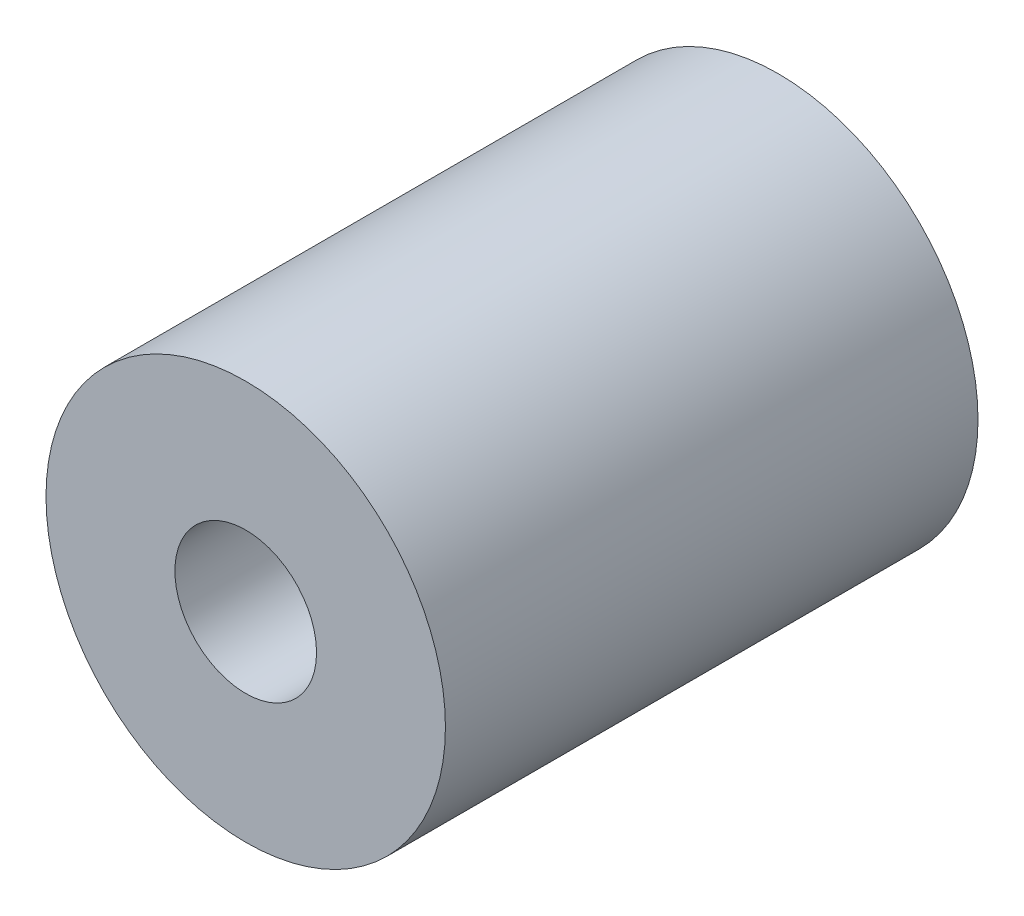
ISO-10303-21;
HEADER;
FILE_DESCRIPTION(('STEP AP214'),'2;1');
FILE_NAME('part.step','',(''),(''),'','','');
FILE_SCHEMA(('AUTOMOTIVE_DESIGN { 1 0 10303 214 1 1 1 1 }'));
ENDSEC;
DATA;
#1=APPLICATION_CONTEXT('core data for automotive mechanical design processes');
#2=APPLICATION_PROTOCOL_DEFINITION('international standard','automotive_design',2000,#1);
#3=PRODUCT_CONTEXT('',#1,'mechanical');
#4=PRODUCT('Part','Part','',(#3));
#5=PRODUCT_RELATED_PRODUCT_CATEGORY('part','',(#4));
#6=PRODUCT_DEFINITION_FORMATION('','',#4);
#7=PRODUCT_DEFINITION_CONTEXT('part definition',#1,'design');
#8=PRODUCT_DEFINITION('design','',#6,#7);
#9=PRODUCT_DEFINITION_SHAPE('','',#8);
#10=(LENGTH_UNIT() NAMED_UNIT(*) SI_UNIT(.MILLI.,.METRE.));
#11=(NAMED_UNIT(*) PLANE_ANGLE_UNIT() SI_UNIT($,.RADIAN.));
#12=(NAMED_UNIT(*) SI_UNIT($,.STERADIAN.) SOLID_ANGLE_UNIT());
#13=UNCERTAINTY_MEASURE_WITH_UNIT(LENGTH_MEASURE(1.E-05),#10,'distance_accuracy_value','');
#14=(GEOMETRIC_REPRESENTATION_CONTEXT(3) GLOBAL_UNCERTAINTY_ASSIGNED_CONTEXT((#13)) GLOBAL_UNIT_ASSIGNED_CONTEXT((#10,
#11,#12)) REPRESENTATION_CONTEXT('',''));
#15=CARTESIAN_POINT('',(0.,0.,0.));
#16=DIRECTION('',(0.,0.,1.));
#17=DIRECTION('',(1.,0.,0.));
#18=AXIS2_PLACEMENT_3D('',#15,#16,#17);
#19=CARTESIAN_POINT('',(0.,0.,12.7));
#20=DIRECTION('',(0.,0.,1.));
#21=DIRECTION('',(1.,0.,0.));
#22=AXIS2_PLACEMENT_3D('',#19,#20,#21);
#23=PLANE('',#22);
#24=CARTESIAN_POINT('',(0.,0.,12.7));
#25=DIRECTION('',(0.,0.,1.));
#26=DIRECTION('',(1.,0.,0.));
#27=AXIS2_PLACEMENT_3D('',#24,#25,#26);
#28=CIRCLE('',#27,9.525);
#29=CARTESIAN_POINT('',(9.525,0.,12.7));
#30=VERTEX_POINT('',#29);
#31=EDGE_CURVE('E12',#30,#30,#28,.T.);
#32=ORIENTED_EDGE('',*,*,#31,.T.);
#33=EDGE_LOOP('',(#32));
#34=FACE_BOUND('',#33,.T.);
#35=CARTESIAN_POINT('',(0.,0.,12.7));
#36=DIRECTION('',(0.,0.,1.));
#37=DIRECTION('',(1.,0.,0.));
#38=AXIS2_PLACEMENT_3D('',#35,#36,#37);
#39=CIRCLE('',#38,3.3782);
#40=CARTESIAN_POINT('',(3.3782,0.,12.7));
#41=VERTEX_POINT('',#40);
#42=EDGE_CURVE('E58',#41,#41,#39,.T.);
#43=ORIENTED_EDGE('',*,*,#42,.F.);
#44=EDGE_LOOP('',(#43));
#45=FACE_BOUND('',#44,.T.);
#46=ADVANCED_FACE('F44',(#34,#45),#23,.T.);
#47=CARTESIAN_POINT('',(0.,0.,-12.7));
#48=DIRECTION('',(0.,0.,1.));
#49=DIRECTION('',(1.,0.,0.));
#50=AXIS2_PLACEMENT_3D('',#47,#48,#49);
#51=PLANE('',#50);
#52=CARTESIAN_POINT('',(0.,0.,-12.7));
#53=DIRECTION('',(0.,0.,1.));
#54=DIRECTION('',(1.,0.,0.));
#55=AXIS2_PLACEMENT_3D('',#52,#53,#54);
#56=CIRCLE('',#55,9.525);
#57=CARTESIAN_POINT('',(9.525,0.,-12.7));
#58=VERTEX_POINT('',#57);
#59=EDGE_CURVE('E48',#58,#58,#56,.T.);
#60=ORIENTED_EDGE('',*,*,#59,.F.);
#61=EDGE_LOOP('',(#60));
#62=FACE_BOUND('',#61,.T.);
#63=CARTESIAN_POINT('',(0.,0.,-12.7));
#64=DIRECTION('',(0.,0.,1.));
#65=DIRECTION('',(1.,0.,0.));
#66=AXIS2_PLACEMENT_3D('',#63,#64,#65);
#67=CIRCLE('',#66,3.3782);
#68=CARTESIAN_POINT('',(3.3782,0.,-12.7));
#69=VERTEX_POINT('',#68);
#70=EDGE_CURVE('E60',#69,#69,#67,.T.);
#71=ORIENTED_EDGE('',*,*,#70,.T.);
#72=EDGE_LOOP('',(#71));
#73=FACE_BOUND('',#72,.T.);
#74=ADVANCED_FACE('F71',(#62,#73),#51,.F.);
#75=CARTESIAN_POINT('',(0.,0.,12.7));
#76=DIRECTION('',(0.,0.,-1.));
#77=DIRECTION('',(-1.,0.,0.));
#78=AXIS2_PLACEMENT_3D('',#75,#76,#77);
#79=CYLINDRICAL_SURFACE('',#78,9.525);
#80=ORIENTED_EDGE('',*,*,#31,.F.);
#81=EDGE_LOOP('',(#80));
#82=FACE_BOUND('',#81,.T.);
#83=ORIENTED_EDGE('',*,*,#59,.T.);
#84=EDGE_LOOP('',(#83));
#85=FACE_BOUND('',#84,.T.);
#86=ADVANCED_FACE('F46',(#82,#85),#79,.T.);
#87=CARTESIAN_POINT('',(0.,0.,12.7));
#88=DIRECTION('',(0.,0.,-1.));
#89=DIRECTION('',(-1.,0.,0.));
#90=AXIS2_PLACEMENT_3D('',#87,#88,#89);
#91=CYLINDRICAL_SURFACE('',#90,3.3782);
#92=ORIENTED_EDGE('',*,*,#42,.T.);
#93=EDGE_LOOP('',(#92));
#94=FACE_BOUND('',#93,.T.);
#95=ORIENTED_EDGE('',*,*,#70,.F.);
#96=EDGE_LOOP('',(#95));
#97=FACE_BOUND('',#96,.T.);
#98=ADVANCED_FACE('F67',(#94,#97),#91,.F.);
#99=CLOSED_SHELL('',(#46,#74,#86,#98));
#100=MANIFOLD_SOLID_BREP('B2',#99);
#101=ADVANCED_BREP_SHAPE_REPRESENTATION('',(#18,#100),#14);
#102=SHAPE_DEFINITION_REPRESENTATION(#9,#101);
ENDSEC;
END-ISO-10303-21;
